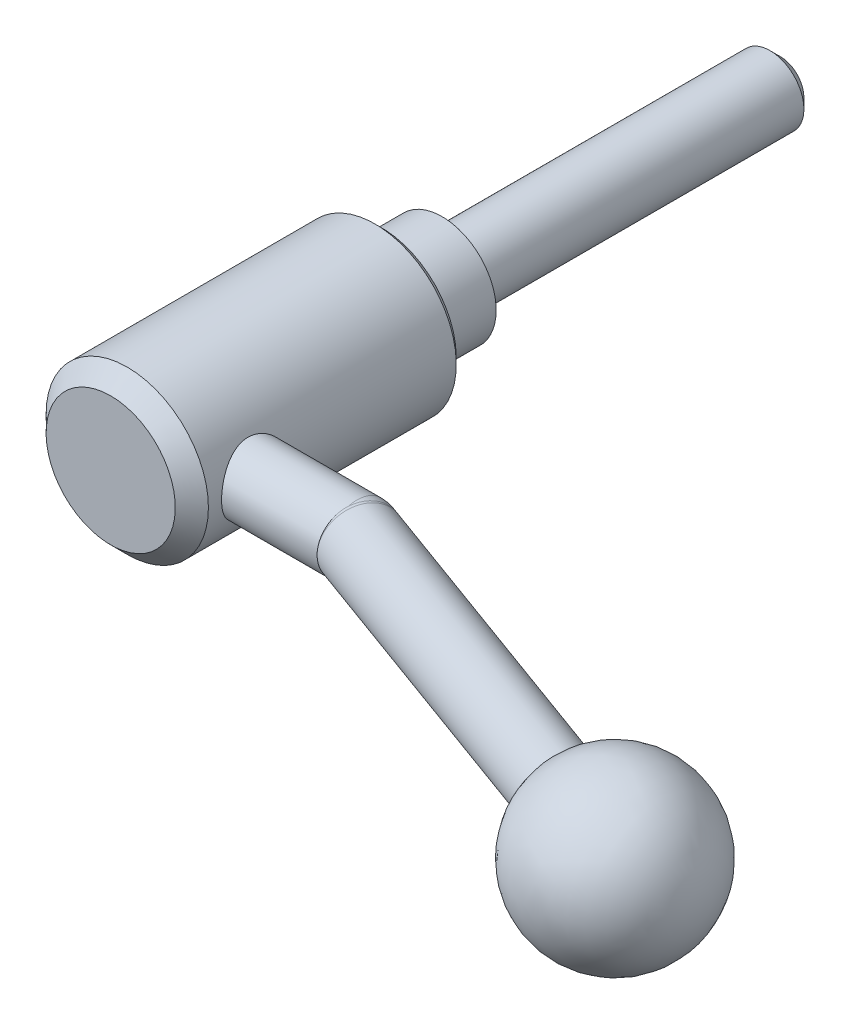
ISO-10303-21;
HEADER;
FILE_DESCRIPTION(('STEP AP214'),'2;1');
FILE_NAME('part.step','',(''),(''),'','','');
FILE_SCHEMA(('AUTOMOTIVE_DESIGN { 1 0 10303 214 1 1 1 1 }'));
ENDSEC;
DATA;
#1=APPLICATION_CONTEXT('core data for automotive mechanical design processes');
#2=APPLICATION_PROTOCOL_DEFINITION('international standard','automotive_design',2000,#1);
#3=PRODUCT_CONTEXT('',#1,'mechanical');
#4=PRODUCT('Part','Part','',(#3));
#5=PRODUCT_RELATED_PRODUCT_CATEGORY('part','',(#4));
#6=PRODUCT_DEFINITION_FORMATION('','',#4);
#7=PRODUCT_DEFINITION_CONTEXT('part definition',#1,'design');
#8=PRODUCT_DEFINITION('design','',#6,#7);
#9=PRODUCT_DEFINITION_SHAPE('','',#8);
#10=(LENGTH_UNIT() NAMED_UNIT(*) SI_UNIT(.MILLI.,.METRE.));
#11=(NAMED_UNIT(*) PLANE_ANGLE_UNIT() SI_UNIT($,.RADIAN.));
#12=(NAMED_UNIT(*) SI_UNIT($,.STERADIAN.) SOLID_ANGLE_UNIT());
#13=UNCERTAINTY_MEASURE_WITH_UNIT(LENGTH_MEASURE(1.E-05),#10,'distance_accuracy_value','');
#14=(GEOMETRIC_REPRESENTATION_CONTEXT(3) GLOBAL_UNCERTAINTY_ASSIGNED_CONTEXT((#13)) GLOBAL_UNIT_ASSIGNED_CONTEXT((#10,
#11,#12)) REPRESENTATION_CONTEXT('',''));
#15=CARTESIAN_POINT('',(0.,0.,0.));
#16=DIRECTION('',(0.,0.,1.));
#17=DIRECTION('',(1.,0.,0.));
#18=AXIS2_PLACEMENT_3D('',#15,#16,#17);
#19=CARTESIAN_POINT('',(6.,0.,0.));
#20=DIRECTION('',(0.,0.,-1.));
#21=DIRECTION('',(0.,1.,0.));
#22=AXIS2_PLACEMENT_3D('',#19,#20,#21);
#23=PLANE('',#22);
#24=CARTESIAN_POINT('',(0.,0.,0.));
#25=DIRECTION('',(0.,0.,1.));
#26=DIRECTION('',(0.,-1.,0.));
#27=AXIS2_PLACEMENT_3D('',#24,#25,#26);
#28=CIRCLE('',#27,8.);
#29=CARTESIAN_POINT('',(0.,-8.,0.));
#30=VERTEX_POINT('',#29);
#31=EDGE_CURVE('E244',#30,#30,#28,.T.);
#32=ORIENTED_EDGE('',*,*,#31,.F.);
#33=EDGE_LOOP('',(#32));
#34=FACE_BOUND('',#33,.T.);
#35=CARTESIAN_POINT('',(0.,0.,0.));
#36=DIRECTION('',(0.,0.,-1.));
#37=DIRECTION('',(-1.,0.,0.));
#38=AXIS2_PLACEMENT_3D('',#35,#36,#37);
#39=CIRCLE('',#38,5.);
#40=CARTESIAN_POINT('',(-5.,0.,0.));
#41=VERTEX_POINT('',#40);
#42=EDGE_CURVE('E248',#41,#41,#39,.T.);
#43=ORIENTED_EDGE('',*,*,#42,.F.);
#44=EDGE_LOOP('',(#43));
#45=FACE_BOUND('',#44,.T.);
#46=ADVANCED_FACE('F14',(#34,#45),#23,.T.);
#47=CARTESIAN_POINT('',(0.,0.,4.5));
#48=DIRECTION('',(0.,0.,1.));
#49=DIRECTION('',(0.,-1.,0.));
#50=AXIS2_PLACEMENT_3D('',#47,#48,#49);
#51=CYLINDRICAL_SURFACE('',#50,8.);
#52=CARTESIAN_POINT('',(0.,0.,9.));
#53=DIRECTION('',(0.,0.,1.));
#54=DIRECTION('',(0.,-1.,0.));
#55=AXIS2_PLACEMENT_3D('',#52,#53,#54);
#56=CIRCLE('',#55,8.);
#57=CARTESIAN_POINT('',(0.,-8.,9.));
#58=VERTEX_POINT('',#57);
#59=EDGE_CURVE('E247',#58,#58,#56,.T.);
#60=ORIENTED_EDGE('',*,*,#59,.F.);
#61=EDGE_LOOP('',(#60));
#62=FACE_BOUND('',#61,.T.);
#63=ORIENTED_EDGE('',*,*,#31,.T.);
#64=EDGE_LOOP('',(#63));
#65=FACE_BOUND('',#64,.T.);
#66=ADVANCED_FACE('F103',(#62,#65),#51,.T.);
#67=CARTESIAN_POINT('',(9.55,0.,9.));
#68=DIRECTION('',(0.,0.,-1.));
#69=DIRECTION('',(0.,1.,0.));
#70=AXIS2_PLACEMENT_3D('',#67,#68,#69);
#71=PLANE('',#70);
#72=ORIENTED_EDGE('',*,*,#59,.T.);
#73=EDGE_LOOP('',(#72));
#74=FACE_BOUND('',#73,.T.);
#75=CARTESIAN_POINT('',(0.,0.,9.));
#76=DIRECTION('',(0.,0.,1.));
#77=DIRECTION('',(0.,-1.,0.));
#78=AXIS2_PLACEMENT_3D('',#75,#76,#77);
#79=CIRCLE('',#78,11.1);
#80=CARTESIAN_POINT('',(0.,-11.1,9.));
#81=VERTEX_POINT('',#80);
#82=EDGE_CURVE('E251',#81,#81,#79,.T.);
#83=ORIENTED_EDGE('',*,*,#82,.F.);
#84=EDGE_LOOP('',(#83));
#85=FACE_BOUND('',#84,.T.);
#86=ADVANCED_FACE('F113',(#74,#85),#71,.T.);
#87=CARTESIAN_POINT('',(4.775,0.,49.));
#88=DIRECTION('',(0.,0.,1.));
#89=DIRECTION('',(0.,-1.,0.));
#90=AXIS2_PLACEMENT_3D('',#87,#88,#89);
#91=PLANE('',#90);
#92=CARTESIAN_POINT('',(0.,0.,49.));
#93=DIRECTION('',(0.,0.,-1.));
#94=DIRECTION('',(0.,1.,0.));
#95=AXIS2_PLACEMENT_3D('',#92,#93,#94);
#96=CIRCLE('',#95,9.55);
#97=CARTESIAN_POINT('',(0.,9.55,49.));
#98=VERTEX_POINT('',#97);
#99=EDGE_CURVE('E253',#98,#98,#96,.T.);
#100=ORIENTED_EDGE('',*,*,#99,.F.);
#101=EDGE_LOOP('',(#100));
#102=FACE_BOUND('',#101,.T.);
#103=ADVANCED_FACE('F122',(#102),#91,.T.);
#104=CARTESIAN_POINT('',(0.,0.,9.9));
#105=DIRECTION('',(0.,0.,1.));
#106=DIRECTION('',(0.,-1.,0.));
#107=AXIS2_PLACEMENT_3D('',#104,#105,#106);
#108=CONICAL_SURFACE('',#107,12.,0.785398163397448);
#109=ORIENTED_EDGE('',*,*,#82,.T.);
#110=EDGE_LOOP('',(#109));
#111=FACE_BOUND('',#110,.T.);
#112=CARTESIAN_POINT('',(0.,0.,9.9));
#113=DIRECTION('',(0.,0.,1.));
#114=DIRECTION('',(0.,-1.,0.));
#115=AXIS2_PLACEMENT_3D('',#112,#113,#114);
#116=CIRCLE('',#115,12.);
#117=CARTESIAN_POINT('',(0.,-12.,9.9));
#118=VERTEX_POINT('',#117);
#119=EDGE_CURVE('E255',#118,#118,#116,.T.);
#120=ORIENTED_EDGE('',*,*,#119,.F.);
#121=EDGE_LOOP('',(#120));
#122=FACE_BOUND('',#121,.T.);
#123=ADVANCED_FACE('F126',(#111,#122),#108,.T.);
#124=CARTESIAN_POINT('',(0.,0.,46.55));
#125=DIRECTION('',(0.,0.,-1.));
#126=DIRECTION('',(0.,1.,0.));
#127=AXIS2_PLACEMENT_3D('',#124,#125,#126);
#128=CONICAL_SURFACE('',#127,12.,0.785398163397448);
#129=CARTESIAN_POINT('',(0.,0.,46.55));
#130=DIRECTION('',(0.,0.,1.));
#131=DIRECTION('',(0.,-1.,0.));
#132=AXIS2_PLACEMENT_3D('',#129,#130,#131);
#133=CIRCLE('',#132,12.);
#134=CARTESIAN_POINT('',(0.,-12.,46.55));
#135=VERTEX_POINT('',#134);
#136=EDGE_CURVE('E47',#135,#135,#133,.F.);
#137=ORIENTED_EDGE('',*,*,#136,.F.);
#138=EDGE_LOOP('',(#137));
#139=FACE_BOUND('',#138,.T.);
#140=ORIENTED_EDGE('',*,*,#99,.T.);
#141=EDGE_LOOP('',(#140));
#142=FACE_BOUND('',#141,.T.);
#143=ADVANCED_FACE('F130',(#139,#142),#128,.T.);
#144=CARTESIAN_POINT('',(0.,0.,28.225));
#145=DIRECTION('',(0.,0.,1.));
#146=DIRECTION('',(0.,-1.,0.));
#147=AXIS2_PLACEMENT_3D('',#144,#145,#146);
#148=CYLINDRICAL_SURFACE('',#147,12.);
#149=ORIENTED_EDGE('',*,*,#119,.T.);
#150=EDGE_LOOP('',(#149));
#151=FACE_BOUND('',#150,.T.);
#152=ORIENTED_EDGE('',*,*,#136,.T.);
#153=EDGE_LOOP('',(#152));
#154=FACE_BOUND('',#153,.T.);
#155=CARTESIAN_POINT('',(10.9087121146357,-5.,39.6));
#156=CARTESIAN_POINT('',(10.9087074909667,-5.00000435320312,39.4663888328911));
#157=CARTESIAN_POINT('',(10.9111719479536,-4.9946421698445,39.332819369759));
#158=CARTESIAN_POINT('',(10.9209330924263,-4.97326581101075,39.0666742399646));
#159=CARTESIAN_POINT('',(10.9282304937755,-4.95725006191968,38.9340987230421));
#160=CARTESIAN_POINT('',(10.9474176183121,-4.91473148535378,38.6709152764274));
#161=CARTESIAN_POINT('',(10.9593097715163,-4.88822310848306,38.5403084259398));
#162=CARTESIAN_POINT('',(10.9872938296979,-4.82499419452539,38.2820015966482));
#163=CARTESIAN_POINT('',(11.0033874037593,-4.78826959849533,38.1543027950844));
#164=CARTESIAN_POINT('',(11.0391954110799,-4.7051251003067,37.9031731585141));
#165=CARTESIAN_POINT('',(11.0588958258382,-4.65874264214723,37.7797279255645));
#166=CARTESIAN_POINT('',(11.1013704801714,-4.55660310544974,37.5373089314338));
#167=CARTESIAN_POINT('',(11.1241458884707,-4.50084246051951,37.4183368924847));
#168=CARTESIAN_POINT('',(11.1961251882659,-4.32013829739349,37.0691963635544));
#169=CARTESIAN_POINT('',(11.2490137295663,-4.18170265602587,36.8465940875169));
#170=CARTESIAN_POINT('',(11.362232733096,-3.8638933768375,36.4146674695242));
#171=CARTESIAN_POINT('',(11.4228143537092,-3.68265681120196,36.2067915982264));
#172=CARTESIAN_POINT('',(11.5425745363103,-3.28806144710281,35.8231953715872));
#173=CARTESIAN_POINT('',(11.6017524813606,-3.07468881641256,35.6474889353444));
#174=CARTESIAN_POINT('',(11.6861286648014,-2.729351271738,35.4081642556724));
#175=CARTESIAN_POINT('',(11.7140590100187,-2.60716588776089,35.3310867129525));
#176=CARTESIAN_POINT('',(11.7671168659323,-2.35613739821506,35.1875758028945));
#177=CARTESIAN_POINT('',(11.7922454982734,-2.22729698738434,35.1211381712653));
#178=CARTESIAN_POINT('',(11.8389586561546,-1.96390692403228,34.9995551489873));
#179=CARTESIAN_POINT('',(11.8605461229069,-1.82936212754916,34.9444003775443));
#180=CARTESIAN_POINT('',(11.8995627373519,-1.55549044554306,34.8458826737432));
#181=CARTESIAN_POINT('',(11.9169929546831,-1.41616480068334,34.802516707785));
#182=CARTESIAN_POINT('',(11.9541941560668,-1.06793180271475,34.7106955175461));
#183=CARTESIAN_POINT('',(11.971276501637,-0.856830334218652,34.6692715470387));
#184=CARTESIAN_POINT('',(11.9941758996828,-0.430450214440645,34.6139291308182));
#185=CARTESIAN_POINT('',(11.9999946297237,-0.21517219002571,34.6000065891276));
#186=CARTESIAN_POINT('',(12.0000033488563,0.134179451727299,34.599995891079));
#187=CARTESIAN_POINT('',(11.9977460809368,0.268317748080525,34.6054032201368));
#188=CARTESIAN_POINT('',(11.9887853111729,0.535617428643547,34.6269647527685));
#189=CARTESIAN_POINT('',(11.9820811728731,0.668778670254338,34.6431204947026));
#190=CARTESIAN_POINT('',(11.9643973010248,0.933147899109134,34.6860218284));
#191=CARTESIAN_POINT('',(11.953415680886,1.06435499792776,34.7127720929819));
#192=CARTESIAN_POINT('',(11.9274624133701,1.32387896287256,34.7765977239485));
#193=CARTESIAN_POINT('',(11.9124892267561,1.45219469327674,34.8136770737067));
#194=CARTESIAN_POINT('',(11.8789883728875,1.70463818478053,34.8976767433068));
#195=CARTESIAN_POINT('',(11.8604718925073,1.82877771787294,34.9445661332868));
#196=CARTESIAN_POINT('',(11.8203169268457,2.07253499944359,35.0478413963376));
#197=CARTESIAN_POINT('',(11.798677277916,2.19215104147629,35.1042308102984));
#198=CARTESIAN_POINT('',(11.7298504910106,2.54307722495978,35.2869746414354));
#199=CARTESIAN_POINT('',(11.6787242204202,2.76669061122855,35.4269801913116));
#200=CARTESIAN_POINT('',(11.5683077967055,3.19783916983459,35.7465298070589));
#201=CARTESIAN_POINT('',(11.5087513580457,3.40417283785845,35.9275881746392));
#202=CARTESIAN_POINT('',(11.3892960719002,3.78466739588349,36.3211115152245));
#203=CARTESIAN_POINT('',(11.3293970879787,3.95881438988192,36.5335899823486));
#204=CARTESIAN_POINT('',(11.2426695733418,4.19642658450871,36.8777228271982));
#205=CARTESIAN_POINT('',(11.2136418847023,4.27318612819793,36.999855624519));
#206=CARTESIAN_POINT('',(11.1581434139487,4.41607290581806,37.2507224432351));
#207=CARTESIAN_POINT('',(11.1316715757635,4.48220453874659,37.3794537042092));
#208=CARTESIAN_POINT('',(11.0821579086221,4.60326626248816,37.6427214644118));
#209=CARTESIAN_POINT('',(11.0591162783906,4.65819570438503,37.7772582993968));
#210=CARTESIAN_POINT('',(11.017290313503,4.75627570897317,38.0511355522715));
#211=CARTESIAN_POINT('',(10.9985037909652,4.7994323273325,38.1904734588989));
#212=CARTESIAN_POINT('',(10.9666619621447,4.87173601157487,38.4661918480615));
#213=CARTESIAN_POINT('',(10.95337593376,4.90145335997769,38.6023961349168));
#214=CARTESIAN_POINT('',(10.9317788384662,4.94943495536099,38.8771389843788));
#215=CARTESIAN_POINT('',(10.9234654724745,4.96770449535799,39.0156764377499));
#216=CARTESIAN_POINT('',(10.9121183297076,4.99258064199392,39.2939753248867));
#217=CARTESIAN_POINT('',(10.9090831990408,4.9991902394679,39.4337364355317));
#218=CARTESIAN_POINT('',(10.9084052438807,5.00066966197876,39.7133300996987));
#219=CARTESIAN_POINT('',(10.9107621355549,4.99554010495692,39.8531626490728));
#220=CARTESIAN_POINT('',(10.9203897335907,4.97445537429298,40.1209853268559));
#221=CARTESIAN_POINT('',(10.9272683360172,4.9593636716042,40.249058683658));
#222=CARTESIAN_POINT('',(10.9453203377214,4.91939458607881,40.5034023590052));
#223=CARTESIAN_POINT('',(10.956495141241,4.89451400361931,40.6296720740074));
#224=CARTESIAN_POINT('',(10.9827914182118,4.83521904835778,40.879504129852));
#225=CARTESIAN_POINT('',(10.9979119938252,4.80080684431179,41.003067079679));
#226=CARTESIAN_POINT('',(11.0316484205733,4.72276748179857,41.2467742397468));
#227=CARTESIAN_POINT('',(11.0502656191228,4.67913677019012,41.366917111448));
#228=CARTESIAN_POINT('',(11.1114356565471,4.5329201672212,41.7260913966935));
#229=CARTESIAN_POINT('',(11.1587373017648,4.41622884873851,41.9587504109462));
#230=CARTESIAN_POINT('',(11.2607390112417,4.14922979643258,42.4019586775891));
#231=CARTESIAN_POINT('',(11.3154417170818,3.99891004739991,42.6124999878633));
#232=CARTESIAN_POINT('',(11.4317082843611,3.65402282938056,43.0243539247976));
#233=CARTESIAN_POINT('',(11.4934615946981,3.45679190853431,43.223388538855));
#234=CARTESIAN_POINT('',(11.6130178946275,3.03093539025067,43.586433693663));
#235=CARTESIAN_POINT('',(11.6708188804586,2.80229404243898,43.7504265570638));
#236=CARTESIAN_POINT('',(11.7505844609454,2.43719005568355,43.9681695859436));
#237=CARTESIAN_POINT('',(11.7762816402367,2.31013401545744,44.0366869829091));
#238=CARTESIAN_POINT('',(11.8243239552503,2.05007418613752,44.1626787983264));
#239=CARTESIAN_POINT('',(11.8466705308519,1.91707298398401,44.2201579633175));
#240=CARTESIAN_POINT('',(11.8873291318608,1.64624850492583,44.3234355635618));
#241=CARTESIAN_POINT('',(11.9056471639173,1.50843276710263,44.3692514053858));
#242=CARTESIAN_POINT('',(11.9377378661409,1.228899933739,44.4488050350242));
#243=CARTESIAN_POINT('',(11.9515124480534,1.08718450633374,44.4825479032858));
#244=CARTESIAN_POINT('',(11.9750487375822,0.788932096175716,44.5398925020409));
#245=CARTESIAN_POINT('',(11.9843764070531,0.63214971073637,44.5624048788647));
#246=CARTESIAN_POINT('',(11.9968515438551,0.316905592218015,44.5924579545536));
#247=CARTESIAN_POINT('',(11.9999991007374,0.158443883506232,44.5999988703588));
#248=CARTESIAN_POINT('',(12.0000007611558,-0.134110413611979,44.6000009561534));
#249=CARTESIAN_POINT('',(11.9977471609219,-0.268208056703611,44.5946001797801));
#250=CARTESIAN_POINT('',(11.9887940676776,-0.535433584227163,44.5730555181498));
#251=CARTESIAN_POINT('',(11.9820932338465,-0.668561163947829,44.5569083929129));
#252=CARTESIAN_POINT('',(11.9644136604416,-0.932940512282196,44.5140182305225));
#253=CARTESIAN_POINT('',(11.9534307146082,-1.06419030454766,44.4872647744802));
#254=CARTESIAN_POINT('',(11.9274719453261,-1.32379800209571,44.4234258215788));
#255=CARTESIAN_POINT('',(11.9124945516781,-1.45215474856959,44.3863362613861));
#256=CARTESIAN_POINT('',(11.8789871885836,-1.70464692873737,44.3023203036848));
#257=CARTESIAN_POINT('',(11.8604692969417,-1.82879507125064,44.2554272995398));
#258=CARTESIAN_POINT('',(11.8203109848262,-2.07256946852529,44.1521432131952));
#259=CARTESIAN_POINT('',(11.798669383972,-2.19219399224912,44.0957485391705));
#260=CARTESIAN_POINT('',(11.7298430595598,-2.5431097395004,43.9130050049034));
#261=CARTESIAN_POINT('',(11.678720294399,-2.76670593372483,43.7730084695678));
#262=CARTESIAN_POINT('',(11.5683124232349,-3.19782111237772,43.4534835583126));
#263=CARTESIAN_POINT('',(11.5087611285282,-3.40413902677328,43.2724414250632));
#264=CARTESIAN_POINT('',(11.3893058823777,-3.78463884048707,42.8789233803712));
#265=CARTESIAN_POINT('',(11.3294017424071,-3.95880157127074,42.6664288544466));
#266=CARTESIAN_POINT('',(11.2426570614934,-4.19646089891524,42.3222273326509));
#267=CARTESIAN_POINT('',(11.2136175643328,-4.27325053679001,42.2000414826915));
#268=CARTESIAN_POINT('',(11.1580975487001,-4.41618919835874,41.9490631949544));
#269=CARTESIAN_POINT('',(11.1316160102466,-4.48234247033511,41.8202734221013));
#270=CARTESIAN_POINT('',(11.0821110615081,-4.60337872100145,41.557006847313));
#271=CARTESIAN_POINT('',(11.059084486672,-4.65827203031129,41.4225353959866));
#272=CARTESIAN_POINT('',(11.0172786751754,-4.75630122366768,41.1487863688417));
#273=CARTESIAN_POINT('',(10.9984982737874,-4.79944033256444,41.0095101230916));
#274=CARTESIAN_POINT('',(10.9584249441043,-4.89044651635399,40.6624381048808));
#275=CARTESIAN_POINT('',(10.9399177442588,-4.93143703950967,40.4524635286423));
#276=CARTESIAN_POINT('',(10.9150663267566,-4.98620740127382,40.028289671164));
#277=CARTESIAN_POINT('',(10.9087195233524,-4.9999930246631,39.8140912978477));
#278=CARTESIAN_POINT('',(10.9087121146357,-5.,39.6));
#279=B_SPLINE_CURVE_WITH_KNOTS('',3,(#155,#156,#157,#158,#159,#160,#161,#162,#163,#164,#165,
#166,#167,#168,#169,#170,#171,#172,#173,#174,#175,#176,#177,#178,#179,#180,#181,#182,#183,#184,
#185,#186,#187,#188,#189,#190,#191,#192,#193,#194,#195,#196,#197,#198,#199,#200,#201,#202,#203,
#204,#205,#206,#207,#208,#209,#210,#211,#212,#213,#214,#215,#216,#217,#218,#219,#220,#221,#222,
#223,#224,#225,#226,#227,#228,#229,#230,#231,#232,#233,#234,#235,#236,#237,#238,#239,#240,#241,
#242,#243,#244,#245,#246,#247,#248,#249,#250,#251,#252,#253,#254,#255,#256,#257,#258,#259,#260,
#261,#262,#263,#264,#265,#266,#267,#268,#269,#270,#271,#272,#273,#274,#275,#276,#277,#278),
.UNSPECIFIED.,.T.,.F.,(4,2,2,2,2,2,2,2,2,2,2,2,2,2,2,2,2,2,2,2,2,2,2,2,2,2,2,2,2,2,2,2,2,2,2,2,
2,2,2,2,2,2,2,2,2,2,2,2,2,2,2,2,2,2,2,2,2,2,2,2,2,4),(0.,0.400632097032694,0.801323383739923,
1.20222687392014,1.60328987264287,2.00282595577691,2.4025143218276,3.20122978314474,
4.04481584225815,4.88876604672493,5.32972022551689,5.77049723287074,6.21090626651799,
6.65120186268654,7.29649650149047,7.94169502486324,8.34403504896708,8.74643267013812,
9.14900797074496,9.55173873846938,9.95321838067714,10.3548479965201,11.1573969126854,
11.9966160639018,12.8361966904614,13.2771668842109,13.7179540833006,14.1587668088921,
14.5993523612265,15.0189121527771,15.4382778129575,15.8575358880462,16.2767718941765,
16.6637453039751,17.0508453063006,17.4378573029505,17.8250187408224,18.6150346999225,
19.4053333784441,20.2623217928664,21.1197415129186,21.5591319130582,21.9983329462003,
22.4368746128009,22.875231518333,23.3503940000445,23.8255495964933,24.2277318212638,
24.6300353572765,25.0327350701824,25.4355933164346,25.837101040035,26.2387608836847,
27.041251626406,27.880402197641,28.7200514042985,29.161206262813,29.6021844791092,
30.042756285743,30.4832070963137,31.1252948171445,31.767245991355),.UNSPECIFIED.);
#280=CARTESIAN_POINT('',(10.9087121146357,-5.,39.6));
#281=VERTEX_POINT('',#280);
#282=EDGE_CURVE('E46',#281,#281,#279,.T.);
#283=ORIENTED_EDGE('',*,*,#282,.F.);
#284=EDGE_LOOP('',(#283));
#285=FACE_BOUND('',#284,.T.);
#286=ADVANCED_FACE('F133',(#151,#154,#285),#148,.T.);
#287=CARTESIAN_POINT('',(27.,0.,39.6));
#288=DIRECTION('',(1.,0.,0.));
#289=DIRECTION('',(0.,0.,1.));
#290=AXIS2_PLACEMENT_3D('',#287,#288,#289);
#291=SPHERICAL_SURFACE('',#290,5.);
#292=CARTESIAN_POINT('',(27.,0.,39.6));
#293=DIRECTION('',(-1.,0.,0.));
#294=DIRECTION('',(0.,-1.,0.));
#295=AXIS2_PLACEMENT_3D('',#292,#293,#294);
#296=CIRCLE('',#295,5.);
#297=CARTESIAN_POINT('',(27.,4.83102779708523,40.8888640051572));
#298=VERTEX_POINT('',#297);
#299=CARTESIAN_POINT('',(27.,-4.83102779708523,40.8888640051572));
#300=VERTEX_POINT('',#299);
#301=EDGE_CURVE('E35',#298,#300,#296,.T.);
#302=ORIENTED_EDGE('',*,*,#301,.F.);
#303=CARTESIAN_POINT('',(27.,-4.83102779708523,40.8888640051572));
#304=CARTESIAN_POINT('',(27.046470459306,-4.86510599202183,40.7611874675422));
#305=CARTESIAN_POINT('',(27.0934341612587,-4.89342279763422,40.632155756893));
#306=CARTESIAN_POINT('',(27.1880079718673,-4.93839650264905,40.3723163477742));
#307=CARTESIAN_POINT('',(27.2356180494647,-4.95505396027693,40.241508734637));
#308=CARTESIAN_POINT('',(27.331115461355,-4.97656756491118,39.979131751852));
#309=CARTESIAN_POINT('',(27.379002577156,-4.98143200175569,39.8475629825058));
#310=CARTESIAN_POINT('',(27.4747462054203,-4.9793538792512,39.5845095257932));
#311=CARTESIAN_POINT('',(27.5226027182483,-4.97241146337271,39.4530248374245));
#312=CARTESIAN_POINT('',(27.6179594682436,-4.94676429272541,39.19103432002));
#313=CARTESIAN_POINT('',(27.665459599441,-4.92805616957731,39.0605287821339));
#314=CARTESIAN_POINT('',(27.7597694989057,-4.87899874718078,38.8014144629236));
#315=CARTESIAN_POINT('',(27.8065790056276,-4.8486451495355,38.6728064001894));
#316=CARTESIAN_POINT('',(27.8991305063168,-4.77653351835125,38.4185232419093));
#317=CARTESIAN_POINT('',(27.9448730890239,-4.73478194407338,38.2928465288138));
#318=CARTESIAN_POINT('',(28.0350097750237,-4.64014604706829,38.0451980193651));
#319=CARTESIAN_POINT('',(28.0794033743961,-4.58725762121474,37.9232276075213));
#320=CARTESIAN_POINT('',(28.1664936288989,-4.47075360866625,37.6839490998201));
#321=CARTESIAN_POINT('',(28.2091908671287,-4.40714174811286,37.5666394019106));
#322=CARTESIAN_POINT('',(28.2926167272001,-4.26960465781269,37.3374287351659));
#323=CARTESIAN_POINT('',(28.3333446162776,-4.19567562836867,37.2255297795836));
#324=CARTESIAN_POINT('',(28.412516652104,-4.03806489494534,37.0080063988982));
#325=CARTESIAN_POINT('',(28.4509612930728,-3.95438531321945,36.9023806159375));
#326=CARTESIAN_POINT('',(28.5253169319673,-3.77782268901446,36.6980901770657));
#327=CARTESIAN_POINT('',(28.5612269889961,-3.6849362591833,36.5994281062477));
#328=CARTESIAN_POINT('',(28.6302280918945,-3.49068679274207,36.4098491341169));
#329=CARTESIAN_POINT('',(28.6633202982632,-3.38932728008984,36.3189290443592));
#330=CARTESIAN_POINT('',(28.7264788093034,-3.1787799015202,36.1454024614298));
#331=CARTESIAN_POINT('',(28.7565439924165,-3.06958915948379,36.0627990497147));
#332=CARTESIAN_POINT('',(28.8134084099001,-2.84423774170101,35.9065653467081));
#333=CARTESIAN_POINT('',(28.8402090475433,-2.72808009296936,35.8329311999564));
#334=CARTESIAN_POINT('',(28.8903782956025,-2.48953382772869,35.6950923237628));
#335=CARTESIAN_POINT('',(28.9137456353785,-2.367142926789,35.6308910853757));
#336=CARTESIAN_POINT('',(28.9568627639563,-2.11708267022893,35.5124277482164));
#337=CARTESIAN_POINT('',(28.9766138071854,-1.98941516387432,35.4581622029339));
#338=CARTESIAN_POINT('',(29.0123746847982,-1.7296246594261,35.3599099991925));
#339=CARTESIAN_POINT('',(29.0283831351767,-1.59750003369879,35.3159271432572));
#340=CARTESIAN_POINT('',(29.0565303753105,-1.32981336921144,35.2385932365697));
#341=CARTESIAN_POINT('',(29.0686705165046,-1.1942525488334,35.20523847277));
#342=CARTESIAN_POINT('',(29.0890073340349,-0.920611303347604,35.1493635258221));
#343=CARTESIAN_POINT('',(29.0972025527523,-0.782529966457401,35.1268473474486));
#344=CARTESIAN_POINT('',(29.1157561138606,-0.36607670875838,35.075871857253));
#345=CARTESIAN_POINT('',(29.1201131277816,-0.0852019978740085,35.0639010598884));
#346=CARTESIAN_POINT('',(29.1126324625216,0.474546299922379,35.0844540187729));
#347=CARTESIAN_POINT('',(29.1007947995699,0.753419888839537,35.1169777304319));
#348=CARTESIAN_POINT('',(29.0612756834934,1.30144109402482,35.2255556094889));
#349=CARTESIAN_POINT('',(29.0335941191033,1.57058864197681,35.3016100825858));
#350=CARTESIAN_POINT('',(28.9631693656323,2.09146114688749,35.495100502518));
#351=CARTESIAN_POINT('',(28.9204263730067,2.34318633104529,35.6125359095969));
#352=CARTESIAN_POINT('',(28.8210936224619,2.82208357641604,35.885450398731));
#353=CARTESIAN_POINT('',(28.764504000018,3.04925587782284,36.0409291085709));
#354=CARTESIAN_POINT('',(28.6390816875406,3.47260490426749,36.3855240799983));
#355=CARTESIAN_POINT('',(28.5702485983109,3.66878061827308,36.5746414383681));
#356=CARTESIAN_POINT('',(28.4222952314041,4.02455922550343,36.9811399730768));
#357=CARTESIAN_POINT('',(28.3431749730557,4.18416218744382,37.1985210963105));
#358=CARTESIAN_POINT('',(28.1768942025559,4.46226027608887,37.6553737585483));
#359=CARTESIAN_POINT('',(28.0897339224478,4.58075658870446,37.8948446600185));
#360=CARTESIAN_POINT('',(27.9098378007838,4.77329945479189,38.3891051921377));
#361=CARTESIAN_POINT('',(27.8171011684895,4.84733968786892,38.6438969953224));
#362=CARTESIAN_POINT('',(27.6287009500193,4.94882287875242,39.1615223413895));
#363=CARTESIAN_POINT('',(27.5330381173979,4.97627773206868,39.4243538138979));
#364=CARTESIAN_POINT('',(27.3636614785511,4.98299294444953,39.8897123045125));
#365=CARTESIAN_POINT('',(27.2899803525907,4.97191840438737,40.0921495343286));
#366=CARTESIAN_POINT('',(27.1803577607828,4.93453780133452,40.393335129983));
#367=CARTESIAN_POINT('',(27.1439766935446,4.91862341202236,40.4932912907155));
#368=CARTESIAN_POINT('',(27.0716363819,4.87994547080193,40.6920446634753));
#369=CARTESIAN_POINT('',(27.035677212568,4.8571807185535,40.7908416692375));
#370=CARTESIAN_POINT('',(27.,4.83102779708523,40.8888640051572));
#371=B_SPLINE_CURVE_WITH_KNOTS('',3,(#303,#304,#305,#306,#307,#308,#309,#310,#311,#312,#313,
#314,#315,#316,#317,#318,#319,#320,#321,#322,#323,#324,#325,#326,#327,#328,#329,#330,#331,#332,
#333,#334,#335,#336,#337,#338,#339,#340,#341,#342,#343,#344,#345,#346,#347,#348,#349,#350,#351,
#352,#353,#354,#355,#356,#357,#358,#359,#360,#361,#362,#363,#364,#365,#366,#367,#368,#369,#370),
.UNSPECIFIED.,.F.,.F.,(4,2,2,2,2,2,2,2,2,2,2,2,2,2,2,2,2,2,2,2,2,2,2,2,2,2,2,2,2,2,2,2,2,4),(0.,
0.420108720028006,0.840197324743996,1.25999054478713,1.67977866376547,2.09968701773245,
2.51975051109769,2.93957644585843,3.35955732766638,3.77939257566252,4.19938285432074,
4.61928189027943,5.03933599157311,5.4592162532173,5.87925151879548,6.29910558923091,
6.71911465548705,7.13897775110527,7.5589958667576,7.9788670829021,8.39889331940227,
9.23803635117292,10.0771785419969,10.9163266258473,11.7554637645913,12.5945926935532,
13.4337489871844,14.2729037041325,15.1120342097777,15.9512839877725,16.7903194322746,
17.4356040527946,17.7580678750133,18.0805882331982),.UNSPECIFIED.);
#372=EDGE_CURVE('E49',#300,#298,#371,.T.);
#373=ORIENTED_EDGE('',*,*,#372,.F.);
#374=EDGE_LOOP('',(#302,#373));
#375=FACE_BOUND('',#374,.T.);
#376=ADVANCED_FACE('F50',(#375),#291,.T.);
#377=CARTESIAN_POINT('',(13.5,0.,39.6));
#378=DIRECTION('',(-1.,0.,0.));
#379=DIRECTION('',(0.,-1.,0.));
#380=AXIS2_PLACEMENT_3D('',#377,#378,#379);
#381=CYLINDRICAL_SURFACE('',#380,5.);
#382=CARTESIAN_POINT('',(26.1183650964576,0.,44.6));
#383=CARTESIAN_POINT('',(26.1183663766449,-0.138781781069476,44.6000146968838));
#384=CARTESIAN_POINT('',(26.1193840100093,-0.277557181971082,44.5942220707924));
#385=CARTESIAN_POINT('',(26.1234602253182,-0.554109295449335,44.571134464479));
#386=CARTESIAN_POINT('',(26.1265186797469,-0.691886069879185,44.5538402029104));
#387=CARTESIAN_POINT('',(26.134682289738,-0.965389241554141,44.5078755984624));
#388=CARTESIAN_POINT('',(26.1397861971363,-1.10111683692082,44.4792121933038));
#389=CARTESIAN_POINT('',(26.1520544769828,-1.36960411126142,44.4107588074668));
#390=CARTESIAN_POINT('',(26.159218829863,-1.50236381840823,44.3709689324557));
#391=CARTESIAN_POINT('',(26.1838439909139,-1.89485404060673,44.2353009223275));
#392=CARTESIAN_POINT('',(26.2044413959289,-2.14895022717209,44.1230982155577));
#393=CARTESIAN_POINT('',(26.2542951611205,-2.63434856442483,43.8587041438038));
#394=CARTESIAN_POINT('',(26.283548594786,-2.86565838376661,43.7065262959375));
#395=CARTESIAN_POINT('',(26.3343916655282,-3.19109256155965,43.4517642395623));
#396=CARTESIAN_POINT('',(26.3525481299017,-3.29619219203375,43.362198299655));
#397=CARTESIAN_POINT('',(26.3913190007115,-3.49841986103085,43.1749160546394));
#398=CARTESIAN_POINT('',(26.4119334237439,-3.59554784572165,43.0771996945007));
#399=CARTESIAN_POINT('',(26.4557847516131,-3.78117775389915,42.8743867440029));
#400=CARTESIAN_POINT('',(26.4790225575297,-3.86967669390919,42.7692876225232));
#401=CARTESIAN_POINT('',(26.5283452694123,-4.0374486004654,42.5525886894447));
#402=CARTESIAN_POINT('',(26.5544301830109,-4.11672154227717,42.4409888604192));
#403=CARTESIAN_POINT('',(26.6091879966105,-4.26396916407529,42.2146533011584));
#404=CARTESIAN_POINT('',(26.6377946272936,-4.33214705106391,42.1000335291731));
#405=CARTESIAN_POINT('',(26.6984986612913,-4.45880346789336,41.8664315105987));
#406=CARTESIAN_POINT('',(26.730595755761,-4.51728285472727,41.7474496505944));
#407=CARTESIAN_POINT('',(26.7818810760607,-4.59750472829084,41.5665481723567));
#408=CARTESIAN_POINT('',(26.7995055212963,-4.6230026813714,41.5058233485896));
#409=CARTESIAN_POINT('',(26.8359327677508,-4.67147271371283,41.3837195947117));
#410=CARTESIAN_POINT('',(26.8547355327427,-4.69444487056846,41.3223406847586));
#411=CARTESIAN_POINT('',(26.893680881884,-4.73784744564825,41.1990839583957));
#412=CARTESIAN_POINT('',(26.9138239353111,-4.75827696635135,41.1372059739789));
#413=CARTESIAN_POINT('',(26.9556781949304,-4.7965760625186,41.0131810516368));
#414=CARTESIAN_POINT('',(26.9773895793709,-4.81444534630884,40.9510340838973));
#415=CARTESIAN_POINT('',(27.,-4.83102779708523,40.8888640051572));
#416=B_SPLINE_CURVE_WITH_KNOTS('',3,(#382,#383,#384,#385,#386,#387,#388,#389,#390,#391,#392,
#393,#394,#395,#396,#397,#398,#399,#400,#401,#402,#403,#404,#405,#406,#407,#408,#409,#410,#411,
#412,#413,#414,#415),.UNSPECIFIED.,.F.,.F.,(4,2,2,2,2,2,2,2,2,2,2,2,2,2,2,2,4),(0.,
0.416209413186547,0.832392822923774,1.24832265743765,1.66424854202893,2.4956357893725,
3.32674227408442,3.74416003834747,4.16158062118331,4.57914501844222,4.99671053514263,
5.40545981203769,5.81417295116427,6.01865864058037,6.22313804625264,6.427689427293,
6.63226409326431),.UNSPECIFIED.);
#417=CARTESIAN_POINT('',(26.1183650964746,0.,44.6));
#418=VERTEX_POINT('',#417);
#419=EDGE_CURVE('E42',#418,#300,#416,.T.);
#420=ORIENTED_EDGE('',*,*,#419,.F.);
#421=CARTESIAN_POINT('',(27.,4.83102779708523,40.8888640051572));
#422=CARTESIAN_POINT('',(26.9769275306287,4.81410598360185,40.9523072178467));
#423=CARTESIAN_POINT('',(26.9547902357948,4.7958439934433,41.0157257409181));
#424=CARTESIAN_POINT('',(26.9121439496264,4.75665385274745,41.1422777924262));
#425=CARTESIAN_POINT('',(26.8916347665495,4.73572601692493,41.2054113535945));
#426=CARTESIAN_POINT('',(26.8520041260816,4.69122201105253,41.331151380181));
#427=CARTESIAN_POINT('',(26.8328821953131,4.66764675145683,41.3937580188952));
#428=CARTESIAN_POINT('',(26.7958563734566,4.6178676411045,41.5182794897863));
#429=CARTESIAN_POINT('',(26.7779525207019,4.59166370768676,41.5801943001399));
#430=CARTESIAN_POINT('',(26.7258878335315,4.5091853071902,41.7645681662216));
#431=CARTESIAN_POINT('',(26.6933404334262,4.44900605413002,41.8857648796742));
#432=CARTESIAN_POINT('',(26.6318437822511,4.3185755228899,42.1235503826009));
#433=CARTESIAN_POINT('',(26.6028947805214,4.24832354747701,42.2401388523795));
#434=CARTESIAN_POINT('',(26.5481524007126,4.0982165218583,42.4676074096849));
#435=CARTESIAN_POINT('',(26.5223565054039,4.01836923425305,42.5784920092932));
#436=CARTESIAN_POINT('',(26.4735791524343,3.84952818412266,42.7937191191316));
#437=CARTESIAN_POINT('',(26.4505976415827,3.76053459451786,42.8980617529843));
#438=CARTESIAN_POINT('',(26.4072342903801,3.57400503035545,43.099329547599));
#439=CARTESIAN_POINT('',(26.3868516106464,3.47647183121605,43.196257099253));
#440=CARTESIAN_POINT('',(26.3485188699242,3.27348573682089,43.3819590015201));
#441=CARTESIAN_POINT('',(26.3305688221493,3.16803279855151,43.4707333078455));
#442=CARTESIAN_POINT('',(26.2968121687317,2.94879128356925,43.6403010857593));
#443=CARTESIAN_POINT('',(26.281029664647,2.83492774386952,43.7210024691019));
#444=CARTESIAN_POINT('',(26.2517361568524,2.60058879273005,43.8727547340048));
#445=CARTESIAN_POINT('',(26.2382262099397,2.4801103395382,43.9438011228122));
#446=CARTESIAN_POINT('',(26.2134181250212,2.23340315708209,44.0756541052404));
#447=CARTESIAN_POINT('',(26.2021207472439,2.10717246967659,44.1364571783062));
#448=CARTESIAN_POINT('',(26.1817011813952,1.84996420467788,44.2472822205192));
#449=CARTESIAN_POINT('',(26.1725779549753,1.71898892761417,44.2973093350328));
#450=CARTESIAN_POINT('',(26.1567996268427,1.45869046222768,44.3843776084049));
#451=CARTESIAN_POINT('',(26.1500579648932,1.32952345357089,44.4218707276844));
#452=CARTESIAN_POINT('',(26.1385146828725,1.06850893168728,44.4863443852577));
#453=CARTESIAN_POINT('',(26.1337130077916,0.936661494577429,44.5133252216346));
#454=CARTESIAN_POINT('',(26.1260342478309,0.671136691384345,44.5565777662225));
#455=CARTESIAN_POINT('',(26.1231575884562,0.537458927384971,44.5728471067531));
#456=CARTESIAN_POINT('',(26.1193234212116,0.269188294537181,44.5945658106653));
#457=CARTESIAN_POINT('',(26.1183660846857,0.134595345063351,44.6000142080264));
#458=CARTESIAN_POINT('',(26.1183650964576,0.,44.6));
#459=B_SPLINE_CURVE_WITH_KNOTS('',3,(#421,#422,#423,#424,#425,#426,#427,#428,#429,#430,#431,
#432,#433,#434,#435,#436,#437,#438,#439,#440,#441,#442,#443,#444,#445,#446,#447,#448,#449,#450,
#451,#452,#453,#454,#455,#456,#457,#458),.UNSPECIFIED.,.F.,.F.,(4,2,2,2,2,2,2,2,2,2,2,2,2,2,2,2,
2,2,4),(0.,0.20876166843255,0.417498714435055,0.626164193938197,0.834836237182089,
1.25182287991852,1.66883840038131,2.08551879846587,2.50219132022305,2.91872892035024,
3.33526878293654,3.75611885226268,4.1771640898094,4.59835374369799,5.01934183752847,
5.42289691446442,5.82644054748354,6.23007335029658,6.63374218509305),.UNSPECIFIED.);
#460=EDGE_CURVE('E44',#298,#418,#459,.T.);
#461=ORIENTED_EDGE('',*,*,#460,.F.);
#462=ORIENTED_EDGE('',*,*,#301,.T.);
#463=EDGE_LOOP('',(#420,#461,#462));
#464=FACE_BOUND('',#463,.T.);
#465=ORIENTED_EDGE('',*,*,#282,.T.);
#466=EDGE_LOOP('',(#465));
#467=FACE_BOUND('',#466,.T.);
#468=ADVANCED_FACE('F39',(#464,#467),#381,.T.);
#469=CARTESIAN_POINT('',(27.828465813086,0.,39.9015368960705));
#470=DIRECTION('',(1.,0.,0.));
#471=DIRECTION('',(0.,0.,1.));
#472=AXIS2_PLACEMENT_3D('',#469,#470,#471);
#473=SPHERICAL_SURFACE('',#472,5.);
#474=ORIENTED_EDGE('',*,*,#372,.T.);
#475=ORIENTED_EDGE('',*,*,#460,.T.);
#476=CARTESIAN_POINT('',(27.8284658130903,0.,39.9015368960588));
#477=DIRECTION('',(-0.939692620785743,0.,-0.342020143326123));
#478=DIRECTION('',(0.342020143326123,0.,-0.939692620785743));
#479=AXIS2_PLACEMENT_3D('',#476,#477,#478);
#480=CIRCLE('',#479,5.);
#481=EDGE_CURVE('E55',#418,#418,#480,.F.);
#482=ORIENTED_EDGE('',*,*,#481,.F.);
#483=ORIENTED_EDGE('',*,*,#419,.T.);
#484=EDGE_LOOP('',(#474,#475,#482,#483));
#485=FACE_BOUND('',#484,.T.);
#486=ADVANCED_FACE('F54',(#485),#473,.T.);
#487=CARTESIAN_POINT('',(52.0314672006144,0.,48.7107089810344));
#488=DIRECTION('',(-0.939692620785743,0.,-0.342020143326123));
#489=DIRECTION('',(0.342020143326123,0.,-0.939692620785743));
#490=AXIS2_PLACEMENT_3D('',#487,#488,#489);
#491=CYLINDRICAL_SURFACE('',#490,5.);
#492=ORIENTED_EDGE('',*,*,#481,.T.);
#493=EDGE_LOOP('',(#492));
#494=FACE_BOUND('',#493,.T.);
#495=CARTESIAN_POINT('',(76.2344685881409,0.,57.5198810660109));
#496=DIRECTION('',(-0.939692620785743,0.,-0.342020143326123));
#497=DIRECTION('',(0.342020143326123,0.,-0.939692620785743));
#498=AXIS2_PLACEMENT_3D('',#495,#496,#497);
#499=CIRCLE('',#498,5.);
#500=CARTESIAN_POINT('',(77.9445693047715,0.,52.8214179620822));
#501=VERTEX_POINT('',#500);
#502=EDGE_CURVE('E240',#501,#501,#499,.F.);
#503=ORIENTED_EDGE('',*,*,#502,.F.);
#504=EDGE_LOOP('',(#503));
#505=FACE_BOUND('',#504,.T.);
#506=ADVANCED_FACE('F81',(#494,#505),#491,.T.);
#507=CARTESIAN_POINT('',(87.,0.,61.4382140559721));
#508=DIRECTION('',(1.,0.,0.));
#509=DIRECTION('',(0.,0.,1.));
#510=AXIS2_PLACEMENT_3D('',#507,#508,#509);
#511=SPHERICAL_SURFACE('',#510,12.5);
#512=CARTESIAN_POINT('',(99.5,0.,61.4382140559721));
#513=VERTEX_POINT('',#512);
#514=VERTEX_LOOP('',#513);
#515=FACE_BOUND('',#514,.T.);
#516=ORIENTED_EDGE('',*,*,#502,.T.);
#517=EDGE_LOOP('',(#516));
#518=FACE_BOUND('',#517,.T.);
#519=ADVANCED_FACE('F91',(#515,#518),#511,.T.);
#520=CARTESIAN_POINT('',(0.,0.,-50.));
#521=DIRECTION('',(0.,0.,1.));
#522=DIRECTION('',(1.,0.,0.));
#523=AXIS2_PLACEMENT_3D('',#520,#521,#522);
#524=CYLINDRICAL_SURFACE('',#523,5.);
#525=CARTESIAN_POINT('',(0.,0.,-48.5));
#526=DIRECTION('',(0.,0.,-1.));
#527=DIRECTION('',(-1.,0.,0.));
#528=AXIS2_PLACEMENT_3D('',#525,#526,#527);
#529=CIRCLE('',#528,5.);
#530=CARTESIAN_POINT('',(-5.,0.,-48.5));
#531=VERTEX_POINT('',#530);
#532=EDGE_CURVE('E9',#531,#531,#529,.F.);
#533=ORIENTED_EDGE('',*,*,#532,.T.);
#534=EDGE_LOOP('',(#533));
#535=FACE_BOUND('',#534,.T.);
#536=ORIENTED_EDGE('',*,*,#42,.T.);
#537=EDGE_LOOP('',(#536));
#538=FACE_BOUND('',#537,.T.);
#539=ADVANCED_FACE('F93',(#535,#538),#524,.T.);
#540=CARTESIAN_POINT('',(1.616603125,0.,-50.));
#541=DIRECTION('',(0.,0.,-1.));
#542=DIRECTION('',(0.,1.,0.));
#543=AXIS2_PLACEMENT_3D('',#540,#541,#542);
#544=PLANE('',#543);
#545=CARTESIAN_POINT('',(0.,0.,-50.));
#546=DIRECTION('',(0.,0.,-1.));
#547=DIRECTION('',(-1.,0.,0.));
#548=AXIS2_PLACEMENT_3D('',#545,#546,#547);
#549=CIRCLE('',#548,3.5);
#550=CARTESIAN_POINT('',(-3.5,0.,-50.));
#551=VERTEX_POINT('',#550);
#552=EDGE_CURVE('E23',#551,#551,#549,.T.);
#553=ORIENTED_EDGE('',*,*,#552,.T.);
#554=EDGE_LOOP('',(#553));
#555=FACE_BOUND('',#554,.T.);
#556=ADVANCED_FACE('F100',(#555),#544,.T.);
#557=CARTESIAN_POINT('',(0.,0.,-50.));
#558=DIRECTION('',(0.,0.,1.));
#559=DIRECTION('',(1.,0.,0.));
#560=AXIS2_PLACEMENT_3D('',#557,#558,#559);
#561=CONICAL_SURFACE('',#560,3.5,0.785398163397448);
#562=ORIENTED_EDGE('',*,*,#532,.F.);
#563=EDGE_LOOP('',(#562));
#564=FACE_BOUND('',#563,.T.);
#565=ORIENTED_EDGE('',*,*,#552,.F.);
#566=EDGE_LOOP('',(#565));
#567=FACE_BOUND('',#566,.T.);
#568=ADVANCED_FACE('F16',(#564,#567),#561,.T.);
#569=CLOSED_SHELL('',(#46,#66,#86,#103,#123,#143,#286,#376,#468,#486,#506,#519,#539,#556,#568));
#570=MANIFOLD_SOLID_BREP('B1',#569);
#571=ADVANCED_BREP_SHAPE_REPRESENTATION('',(#18,#570),#14);
#572=SHAPE_DEFINITION_REPRESENTATION(#9,#571);
ENDSEC;
END-ISO-10303-21;
